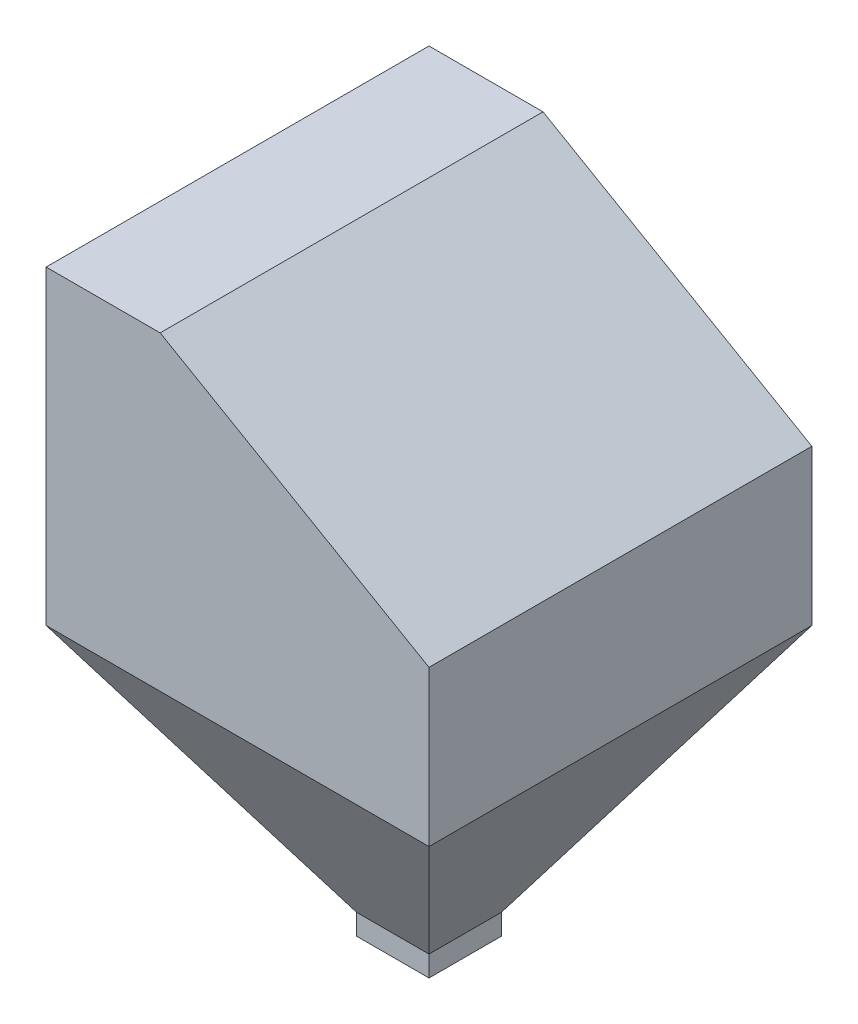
from build123d import *

# Parameters (mm, degrees)
SKETCH3_W               = 925
SKETCH3_H               = 925
BOSS_EXTRUDE1_DEPTH     = 750
CUT_EXTRUDE1_DEPTH      = 1701.597321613
CUT_EXTRUDE1_DEPTH_BACK = 1701.597321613
SKETCH5_W               = 175
SKETCH5_H               = 175
BOSS_EXTRUDE2_DEPTH     = 50


with BuildPart() as part:
    # Sketch1 → Loft1 section 0
    with BuildSketch(Plane(origin=(0, 0, 0), x_dir=(1, 0, 0), z_dir=(0, 1, 0))):
        with BuildLine():
            Line((-87.5, -87.5), (87.5, -87.5))
            Line((87.5, -87.5), (87.5, 87.5))
            Line((87.5, 87.5), (-87.5, 87.5))
            Line((-87.5, 87.5), (-87.5, -87.5))
        make_face()
    # Sketch2 → Loft1 section 1
    with BuildSketch(Plane(origin=(0, 600, 0), x_dir=(1, 0, 0), z_dir=(0, 1, 0))):
        with BuildLine():
            Line((-462.5, -462.5), (462.5, -462.5))
            Line((462.5, -462.5), (462.5, 462.5))
            Line((462.5, 462.5), (-462.5, 462.5))
            Line((-462.5, 462.5), (-462.5, -462.5))
        make_face()
    loft()

    # Sketch3 → Boss-Extrude1 (add)
    with BuildSketch(Plane(origin=(0, 600, 0), x_dir=(1, 0, 0), z_dir=(0, 1, 0))):
        Rectangle(SKETCH3_W, SKETCH3_H)
    extrude(amount=BOSS_EXTRUDE1_DEPTH)

    # Sketch4 → Cut-Extrude1 (cut, two sides: drawn at the far end of the back side and taken through both)
    with BuildSketch(Plane.XY.offset(462.5).offset(-CUT_EXTRUDE1_DEPTH_BACK)):
        Polygon((3065.98683807, -528.123826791), (462.5, 975), (-187.019052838, 1350), (-2790.505890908, 2853.123826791), (215.741762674, 8060.097502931), (6072.234491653, 4678.849849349), align=None)
    extrude(amount=CUT_EXTRUDE1_DEPTH + CUT_EXTRUDE1_DEPTH_BACK, mode=Mode.SUBTRACT)

    # Sketch5 → Boss-Extrude2 (add)
    with BuildSketch(Plane.XZ):
        Rectangle(SKETCH5_W, SKETCH5_H)
    extrude(amount=BOSS_EXTRUDE2_DEPTH)


solid = part.part
